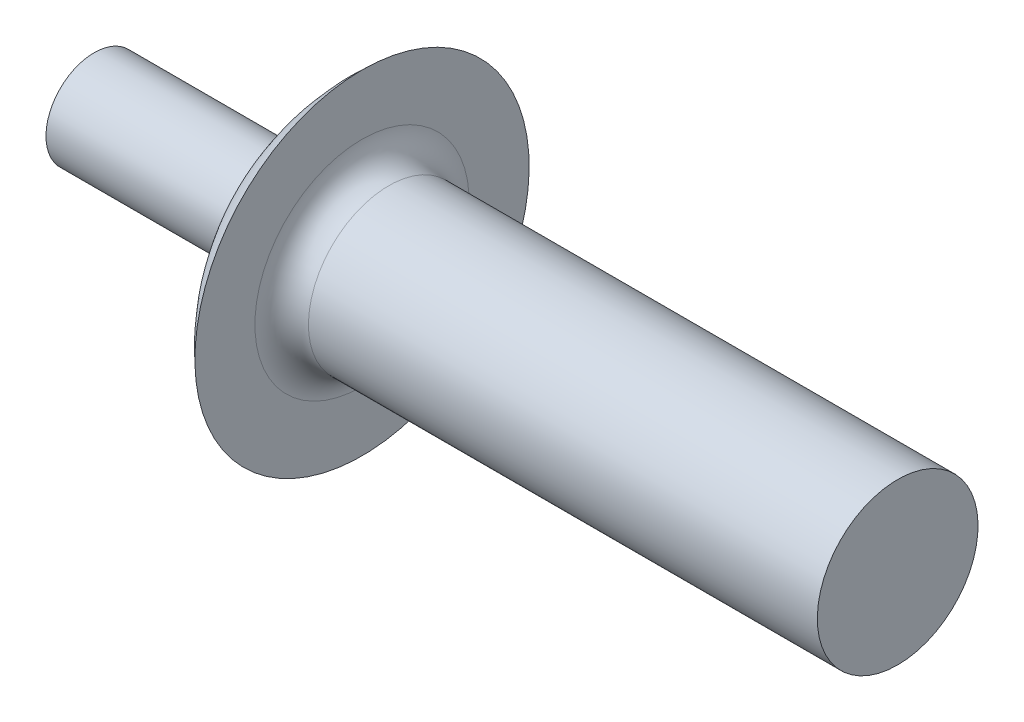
from build123d import *

# Parameters (mm, degrees)
FILLET1_R = 0.5


with BuildPart() as part:
    # Sketch1 → Base-Revolve (revolve)
    with BuildSketch(Plane(origin=(13.241356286, 10.121356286, 0), x_dir=(0, 1, 0), z_dir=(0, 0, 1)), mode=Mode.PRIVATE) as base_revolve_sk:
        with BuildLine():
            Line((-10.121356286, -1.758643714), (-8.621356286, -1.758643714))
            Line((-8.621356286, -1.758643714), (-8.621356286, 8.241356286))
            Line((-8.621356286, 8.241356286), (-7.001356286, 8.241356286))
            ThreePointArc((-7.001356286, 8.241356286), (-8.008580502, 9.067551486), (-9.221356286, 9.543234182))
            Line((-9.221356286, 9.543234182), (-9.221356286, 13.241356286))
            Line((-9.221356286, 13.241356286), (-10.121356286, 13.241356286))
            Line((-10.121356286, 13.241356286), (-10.121356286, -1.758643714))
        make_face()
    revolve(base_revolve_sk.sketch.rotate(Axis((-21.096328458, 0, 0), (1, 0, 0)), 180), axis=Axis((-21.096328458, 0, 0), (1, 0, 0)))

    # Fillet1
    fillet1_edges = [part.edges().sort_by_distance(p)[0] for p in [
        (5, 1.5, 0),
    ]]
    fillet(fillet1_edges, radius=FILLET1_R)


solid = part.part
